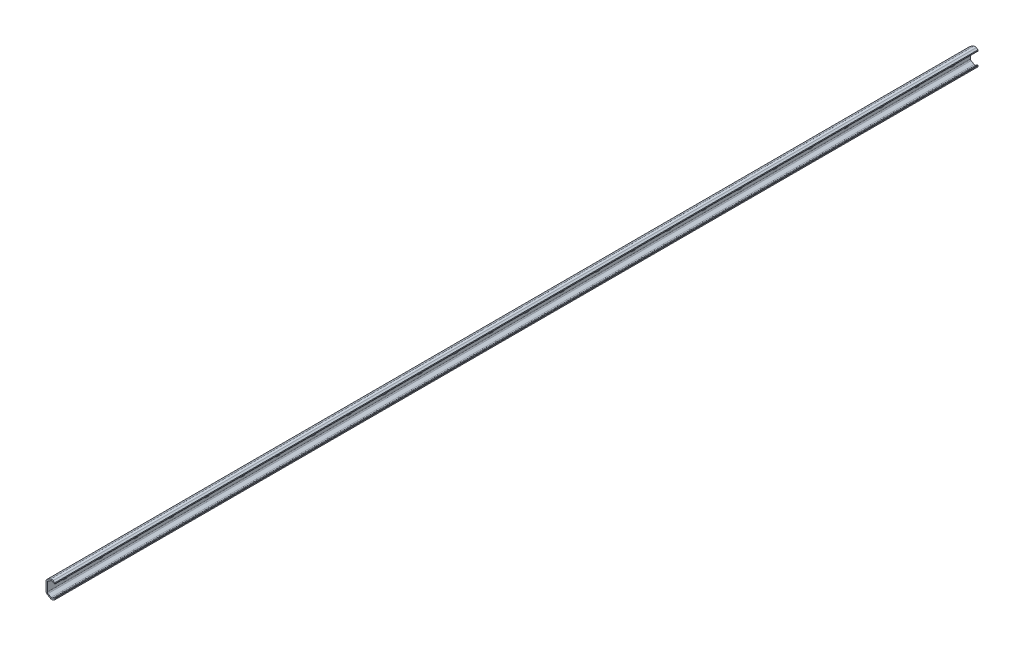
from build123d import *

# Parameters (mm, degrees)
BOSS_EXTRUDE1_DEPTH = 2080
CUT_EXTRUDE1_DEPTH  = 2081.163362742
LPATTERN1_COUNT     = 26
LPATTERN1_PITCH     = 80


with BuildPart() as part:
    # Sketch1 → Boss-Extrude1 (new body)
    with BuildSketch(Plane.XY):
        with BuildLine():
            Line((19.499613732, 13.474805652), (19.999997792, 14.341496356))
            Line((19.999997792, 14.341496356), (19.999997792, 16.649985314))
            Line((19.999997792, 16.649985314), (16.076193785, 18.915394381))
            ThreePointArc((16.076193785, 18.915394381), (13.043994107, 19.73984446), (9.999984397, 18.960128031))
            Line((9.999984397, 18.960128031), (2.999981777, 14.918641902))
            ThreePointArc((2.999981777, 14.918641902), (0.803842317, 12.722490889), (0, 9.7225))
            Line((0, 9.7225), (0, 0))
            Line((0, 0), (0, -9.7225))
            ThreePointArc((0, -9.7225), (0.803842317, -12.722490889), (2.999981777, -14.918641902))
            Line((2.999981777, -14.918641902), (9.999984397, -18.960128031))
            ThreePointArc((9.999984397, -18.960128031), (13.044170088, -19.763823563), (16.076193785, -18.915398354))
            Line((16.076193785, -18.915398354), (19.999997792, -16.649989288))
            Line((19.999997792, -16.649989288), (19.999997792, -14.34150033))
            Line((19.999997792, -14.34150033), (19.499613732, -13.474809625))
            Line((19.499613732, -13.474809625), (14.553790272, -16.330281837))
            ThreePointArc((14.553790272, -16.330281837), (13.031057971, -16.746803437), (11.499984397, -16.362072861))
            Line((11.499984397, -16.362072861), (4.499981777, -12.320586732))
            ThreePointArc((4.499981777, -12.320586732), (3.401905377, -11.222504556), (2.999981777, -9.7225))
            Line((2.999981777, -9.7225), (2.999981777, 9.7225))
            ThreePointArc((2.999981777, 9.7225), (3.401905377, 11.222504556), (4.499981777, 12.320586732))
            Line((4.499981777, 12.320586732), (11.499984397, 16.362072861))
            ThreePointArc((11.499984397, 16.362072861), (13.031235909, 16.763841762), (14.553790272, 16.330277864))
            Line((14.553790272, 16.330277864), (19.499613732, 13.474805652))
        make_face()
    extrude(amount=-BOSS_EXTRUDE1_DEPTH)

    # Sketch2 → Cut-Extrude1 (cut, through all)
    with BuildSketch(Plane(origin=(2.999981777, 0, 0), x_dir=(0, 0, -1), z_dir=(1, 0, 0))):
        with BuildLine():
            Line((42, -4.5), (38, -4.5))
            ThreePointArc((38, -4.5), (33.5, 0), (38, 4.5))
            Line((38, 4.5), (42, 4.5))
            ThreePointArc((42, 4.5), (46.5, 0), (42, -4.5))
        make_face()
    cut_extrude1 = extrude(amount=-CUT_EXTRUDE1_DEPTH, mode=Mode.SUBTRACT)

    # LPattern1: Cut-Extrude1 ×26
    with Locations(*[(0, 0, -i * LPATTERN1_PITCH) for i in range(1, LPATTERN1_COUNT)]):
        add(cut_extrude1, mode=Mode.SUBTRACT)


solid = part.part
